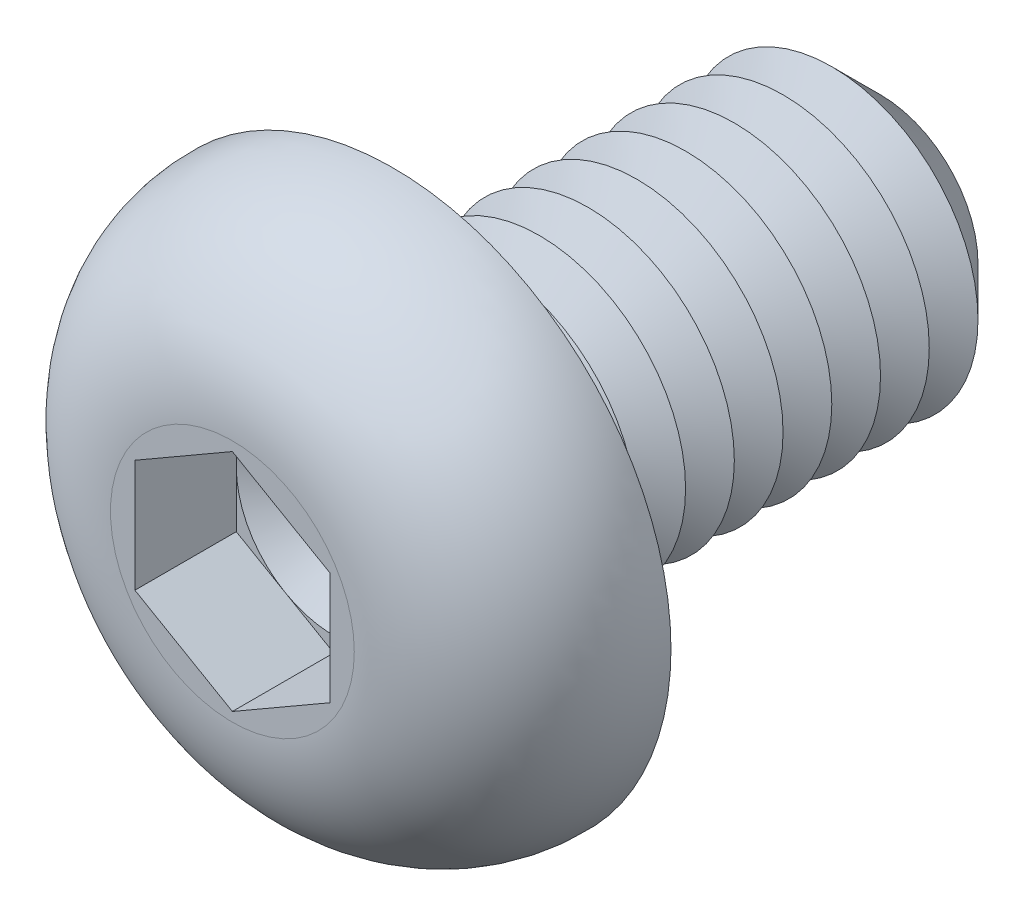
from build123d import *

# Parameters (mm, degrees)
CUT_EXTRUDE1_DEPTH  = 1.04
SKETCH4_R           = 1.5
BOSS_EXTRUDE1_DEPTH = 5
CHAMFER1_SIZE       = 0.5
LPATTERN1_COUNT     = 8
LPATTERN1_PITCH     = 0.5
FILLET2_R           = 0.2


with BuildPart() as part:
    # Sketch2 → Revolve1 (revolve)
    with BuildSketch(Plane(origin=(0, 0, 0), x_dir=(0, 0, -1), z_dir=(1, 0, 0)), mode=Mode.PRIVATE) as revolve1_sk:
        with BuildLine():
            Line((0, 0), (-1.65, 0))
            Line((-1.65, 0), (-1.65, 1.250781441))
            ThreePointArc((-1.65, 1.250781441), (-1.163552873, 2.39969397), (0, 2.85))
            Line((0, 2.85), (0, 0))
        make_face()
    revolve(revolve1_sk.sketch.rotate(Axis((0, 0, 47.934239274), (0, 0, -1)), 90), axis=Axis((0, 0, 47.934239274), (0, 0, -1)))

    # Sketch3 → Cut-Extrude1 (cut)
    with BuildSketch(Plane.XY.offset(1.65)):
        Polygon((0, 1.154700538), (-1, 0.577350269), (-1, -0.577350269), (0, -1.154700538), (1, -0.577350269), (1, 0.577350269), align=None)
    extrude(amount=-CUT_EXTRUDE1_DEPTH, mode=Mode.SUBTRACT)

    # Sketch4 → Boss-Extrude1 (add)
    with BuildSketch(Plane(origin=(0, 0, 0), x_dir=(-1, 0, 0), z_dir=(0, 0, -1))):
        with Locations(Location((0, 0, 0), (0, 0, 180))):
            Circle(SKETCH4_R)
    extrude(amount=BOSS_EXTRUDE1_DEPTH)

    # Chamfer1
    chamfer1_edges = [part.edges().sort_by_distance(p)[0] for p in [
        (-1.5, 0, -5),
    ]]
    chamfer(chamfer1_edges, length=CHAMFER1_SIZE)

    # Sketch5 → Cut-Revolve1 (revolve, cut)
    with BuildSketch(Plane(origin=(0, 0, 0), x_dir=(0, 0, -1), z_dir=(1, 0, 0)), mode=Mode.PRIVATE) as cut_revolve1_sk:
        Polygon((0.5, 1.5), (1, 1.5), (0.75, 1.066987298), align=None)
    cut_revolve1 = revolve(cut_revolve1_sk.sketch.rotate(Axis((0, 0, 47.934239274), (0, 0, -1)), 90), axis=Axis((0, 0, 47.934239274), (0, 0, -1)), mode=Mode.SUBTRACT)

    # LPattern1: Cut-Revolve1 ×8
    with Locations(*[(0, 0, -i * LPATTERN1_PITCH) for i in range(1, LPATTERN1_COUNT)]):
        add(cut_revolve1, mode=Mode.SUBTRACT)

    # Fillet2
    fillet2_edges = [part.edges().sort_by_distance(p)[0] for p in [
        (-1.5, 0, 0),
    ]]
    fillet(fillet2_edges, radius=FILLET2_R)

    # Cut-Extrude2 cone 1 section (on through the dimple's axis) → Cut-Extrude2 (revolve, cut)
    with BuildSketch(Plane(origin=(0, 0, 0.61), x_dir=(0, -1, 0), z_dir=(1, 0, 0))):
        Polygon((0, 0), (1, 0), (0, 0.577350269), align=None)
    revolve(axis=Axis((0, 0, 0.61), (0, 0, -1)), mode=Mode.SUBTRACT)


solid = part.part
